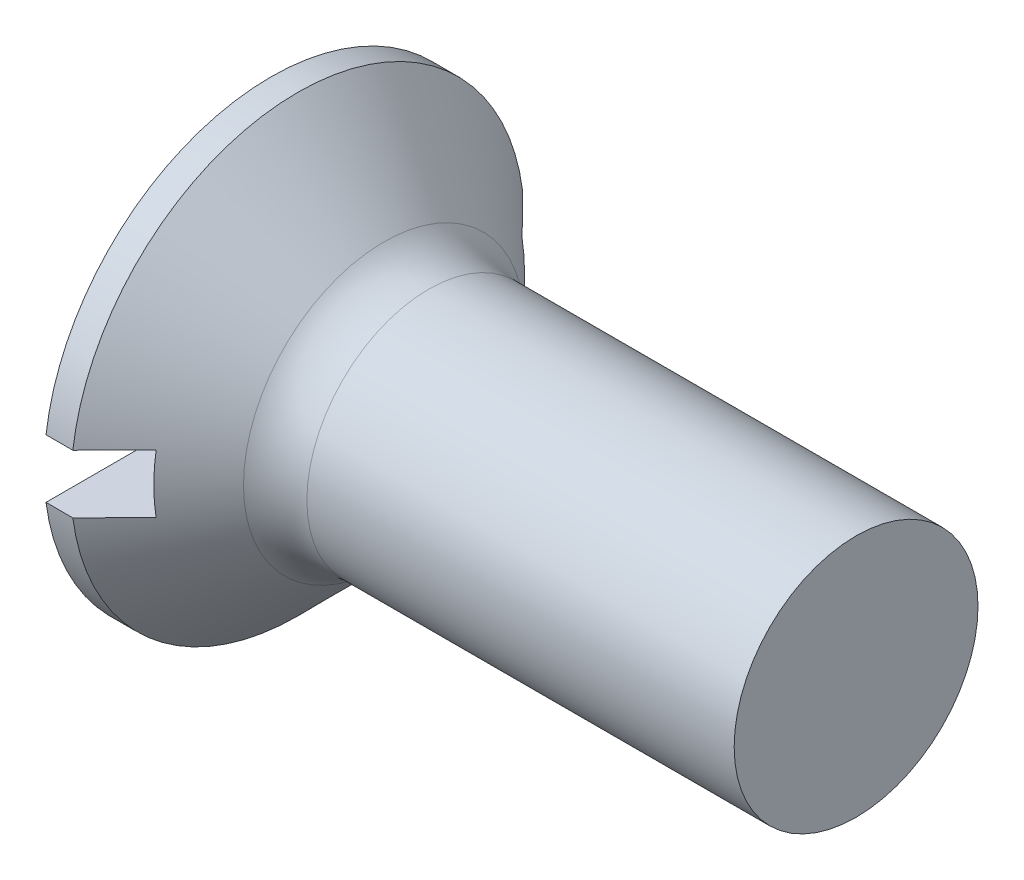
ISO-10303-21;
HEADER;
FILE_DESCRIPTION(('STEP AP214'),'2;1');
FILE_NAME('part.step','',(''),(''),'','','');
FILE_SCHEMA(('AUTOMOTIVE_DESIGN { 1 0 10303 214 1 1 1 1 }'));
ENDSEC;
DATA;
#1=APPLICATION_CONTEXT('core data for automotive mechanical design processes');
#2=APPLICATION_PROTOCOL_DEFINITION('international standard','automotive_design',2000,#1);
#3=PRODUCT_CONTEXT('',#1,'mechanical');
#4=PRODUCT('Part','Part','',(#3));
#5=PRODUCT_RELATED_PRODUCT_CATEGORY('part','',(#4));
#6=PRODUCT_DEFINITION_FORMATION('','',#4);
#7=PRODUCT_DEFINITION_CONTEXT('part definition',#1,'design');
#8=PRODUCT_DEFINITION('design','',#6,#7);
#9=PRODUCT_DEFINITION_SHAPE('','',#8);
#10=(LENGTH_UNIT() NAMED_UNIT(*) SI_UNIT(.MILLI.,.METRE.));
#11=(NAMED_UNIT(*) PLANE_ANGLE_UNIT() SI_UNIT($,.RADIAN.));
#12=(NAMED_UNIT(*) SI_UNIT($,.STERADIAN.) SOLID_ANGLE_UNIT());
#13=UNCERTAINTY_MEASURE_WITH_UNIT(LENGTH_MEASURE(1.E-05),#10,'distance_accuracy_value','');
#14=(GEOMETRIC_REPRESENTATION_CONTEXT(3) GLOBAL_UNCERTAINTY_ASSIGNED_CONTEXT((#13)) GLOBAL_UNIT_ASSIGNED_CONTEXT((#10,
#11,#12)) REPRESENTATION_CONTEXT('',''));
#15=CARTESIAN_POINT('',(0.,0.,0.));
#16=DIRECTION('',(0.,0.,1.));
#17=DIRECTION('',(1.,0.,0.));
#18=AXIS2_PLACEMENT_3D('',#15,#16,#17);
#19=CARTESIAN_POINT('',(0.,0.,0.));
#20=DIRECTION('',(-1.,0.,0.));
#21=DIRECTION('',(0.,0.,1.));
#22=AXIS2_PLACEMENT_3D('',#19,#20,#21);
#23=PLANE('',#22);
#24=DIRECTION('',(0.,0.,-1.));
#25=VECTOR('',#24,1.);
#26=CARTESIAN_POINT('',(0.,0.600000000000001,4.65));
#27=LINE('',#26,#25);
#28=CARTESIAN_POINT('',(0.,0.600000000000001,4.61112784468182));
#29=VERTEX_POINT('',#28);
#30=CARTESIAN_POINT('',(0.,0.599999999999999,-4.61112784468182));
#31=VERTEX_POINT('',#30);
#32=EDGE_CURVE('E169',#29,#31,#27,.T.);
#33=ORIENTED_EDGE('',*,*,#32,.F.);
#34=CARTESIAN_POINT('',(0.,0.,0.));
#35=DIRECTION('',(-1.,0.,0.));
#36=DIRECTION('',(0.,0.,1.));
#37=AXIS2_PLACEMENT_3D('',#34,#35,#36);
#38=CIRCLE('',#37,4.65);
#39=EDGE_CURVE('E113',#29,#31,#38,.T.);
#40=ORIENTED_EDGE('',*,*,#39,.T.);
#41=EDGE_LOOP('',(#33,#40));
#42=FACE_BOUND('',#41,.T.);
#43=ADVANCED_FACE('F32',(#42),#23,.T.);
#44=CARTESIAN_POINT('',(-6.34999999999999,0.,0.));
#45=DIRECTION('',(-1.,0.,0.));
#46=DIRECTION('',(0.,0.,1.));
#47=AXIS2_PLACEMENT_3D('',#44,#45,#46);
#48=CYLINDRICAL_SURFACE('',#47,4.65);
#49=DIRECTION('',(-1.,0.,0.));
#50=VECTOR('',#49,1.);
#51=CARTESIAN_POINT('',(-6.34999999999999,0.599999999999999,-4.61112784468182));
#52=LINE('',#51,#50);
#53=CARTESIAN_POINT('',(0.550000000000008,0.599999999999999,-4.61112784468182));
#54=VERTEX_POINT('',#53);
#55=EDGE_CURVE('E60',#31,#54,#52,.F.);
#56=ORIENTED_EDGE('',*,*,#55,.F.);
#57=ORIENTED_EDGE('',*,*,#39,.F.);
#58=DIRECTION('',(-1.,0.,0.));
#59=VECTOR('',#58,1.);
#60=CARTESIAN_POINT('',(-6.34999999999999,0.600000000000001,4.61112784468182));
#61=LINE('',#60,#59);
#62=CARTESIAN_POINT('',(0.550000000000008,0.600000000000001,4.61112784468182));
#63=VERTEX_POINT('',#62);
#64=EDGE_CURVE('E175',#63,#29,#61,.T.);
#65=ORIENTED_EDGE('',*,*,#64,.F.);
#66=CARTESIAN_POINT('',(0.550000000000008,0.,0.));
#67=DIRECTION('',(-1.,0.,0.));
#68=DIRECTION('',(0.,0.,1.));
#69=AXIS2_PLACEMENT_3D('',#66,#67,#68);
#70=CIRCLE('',#69,4.65);
#71=EDGE_CURVE('E107',#63,#54,#70,.T.);
#72=ORIENTED_EDGE('',*,*,#71,.T.);
#73=EDGE_LOOP('',(#56,#57,#65,#72));
#74=FACE_BOUND('',#73,.T.);
#75=ADVANCED_FACE('F153',(#74),#48,.T.);
#76=DIRECTION('',(0.,0.,1.));
#77=VECTOR('',#76,1.);
#78=CARTESIAN_POINT('',(0.,-0.600000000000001,-4.65));
#79=LINE('',#78,#77);
#80=CARTESIAN_POINT('',(0.,-0.600000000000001,-4.61112784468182));
#81=VERTEX_POINT('',#80);
#82=CARTESIAN_POINT('',(0.,-0.600000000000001,4.61112784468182));
#83=VERTEX_POINT('',#82);
#84=EDGE_CURVE('E101',#81,#83,#79,.T.);
#85=ORIENTED_EDGE('',*,*,#84,.F.);
#86=EDGE_CURVE('E109',#81,#83,#38,.T.);
#87=ORIENTED_EDGE('',*,*,#86,.T.);
#88=EDGE_LOOP('',(#85,#87));
#89=FACE_BOUND('',#88,.T.);
#90=ADVANCED_FACE('F155',(#89),#23,.T.);
#91=DIRECTION('',(-1.,0.,0.));
#92=VECTOR('',#91,1.);
#93=CARTESIAN_POINT('',(-6.34999999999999,-0.600000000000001,4.61112784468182));
#94=LINE('',#93,#92);
#95=CARTESIAN_POINT('',(0.550000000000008,-0.600000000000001,4.61112784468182));
#96=VERTEX_POINT('',#95);
#97=EDGE_CURVE('E174',#83,#96,#94,.F.);
#98=ORIENTED_EDGE('',*,*,#97,.F.);
#99=ORIENTED_EDGE('',*,*,#86,.F.);
#100=DIRECTION('',(-1.,0.,0.));
#101=VECTOR('',#100,1.);
#102=CARTESIAN_POINT('',(-6.34999999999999,-0.600000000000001,-4.61112784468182));
#103=LINE('',#102,#101);
#104=CARTESIAN_POINT('',(0.550000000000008,-0.600000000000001,-4.61112784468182));
#105=VERTEX_POINT('',#104);
#106=EDGE_CURVE('E172',#105,#81,#103,.T.);
#107=ORIENTED_EDGE('',*,*,#106,.F.);
#108=EDGE_CURVE('E110',#105,#96,#70,.T.);
#109=ORIENTED_EDGE('',*,*,#108,.T.);
#110=EDGE_LOOP('',(#98,#99,#107,#109));
#111=FACE_BOUND('',#110,.T.);
#112=ADVANCED_FACE('F150',(#111),#48,.T.);
#113=CARTESIAN_POINT('',(0.550000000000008,0.,0.));
#114=DIRECTION('',(-1.,0.,0.));
#115=DIRECTION('',(0.,0.,1.));
#116=AXIS2_PLACEMENT_3D('',#113,#114,#115);
#117=CONICAL_SURFACE('',#116,4.65,0.78539816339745);
#118=CARTESIAN_POINT('',(-5.05345798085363,0.599999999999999,-10.2358878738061));
#119=CARTESIAN_POINT('',(-4.7063338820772,0.599999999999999,-9.88816346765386));
#120=CARTESIAN_POINT('',(-4.35923588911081,0.599999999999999,-9.54041298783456));
#121=CARTESIAN_POINT('',(-3.66512028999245,0.599999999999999,-8.84482295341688));
#122=CARTESIAN_POINT('',(-3.31810268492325,0.599999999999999,-8.49698339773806));
#123=CARTESIAN_POINT('',(-2.6240861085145,0.599999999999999,-7.80108810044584));
#124=CARTESIAN_POINT('',(-2.27708717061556,0.599999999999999,-7.45303232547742));
#125=CARTESIAN_POINT('',(-1.58327190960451,0.599999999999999,-6.75674744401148));
#126=CARTESIAN_POINT('',(-1.23645558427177,0.599999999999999,-6.40851833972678));
#127=CARTESIAN_POINT('',(-0.530234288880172,0.599999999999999,-5.69884909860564));
#128=CARTESIAN_POINT('',(-0.170839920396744,0.599999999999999,-5.3373984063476));
#129=CARTESIAN_POINT('',(0.367846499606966,0.599999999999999,-4.79480605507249));
#130=CARTESIAN_POINT('',(0.547344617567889,0.599999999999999,-4.61386901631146));
#131=CARTESIAN_POINT('',(0.906142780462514,0.599999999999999,-4.251800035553));
#132=CARTESIAN_POINT('',(1.08544282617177,0.6,-4.07066809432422));
#133=CARTESIAN_POINT('',(1.44372217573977,0.6,-3.70815209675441));
#134=CARTESIAN_POINT('',(1.62270153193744,0.6,-3.52676809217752));
#135=CARTESIAN_POINT('',(1.98021132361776,0.6,-3.16355280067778));
#136=CARTESIAN_POINT('',(2.1587417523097,0.6,-2.98172150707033));
#137=CARTESIAN_POINT('',(2.51504600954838,0.6,-2.61734150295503));
#138=CARTESIAN_POINT('',(2.69281988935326,0.6,-2.43479284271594));
#139=CARTESIAN_POINT('',(2.95840184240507,0.6,-2.15993102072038));
#140=CARTESIAN_POINT('',(3.0467482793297,0.6,-2.06813839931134));
#141=CARTESIAN_POINT('',(3.22290791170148,0.6,-1.8840432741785));
#142=CARTESIAN_POINT('',(3.31072111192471,0.6,-1.79174077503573));
#143=CARTESIAN_POINT('',(3.44507973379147,0.6,-1.64924720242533));
#144=CARTESIAN_POINT('',(3.49191887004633,0.6,-1.59933324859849));
#145=CARTESIAN_POINT('',(3.58528403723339,0.6,-1.49921165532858));
#146=CARTESIAN_POINT('',(3.63181006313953,0.6,-1.44900401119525));
#147=CARTESIAN_POINT('',(3.72427703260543,0.6,-1.348388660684));
#148=CARTESIAN_POINT('',(3.77021949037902,0.6,-1.29798234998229));
#149=CARTESIAN_POINT('',(3.86152904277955,0.6,-1.19665513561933));
#150=CARTESIAN_POINT('',(3.90689615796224,0.6,-1.1457342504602));
#151=CARTESIAN_POINT('',(4.01209252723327,0.6,-1.02578570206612));
#152=CARTESIAN_POINT('',(4.07160553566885,0.6,-0.956477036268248));
#153=CARTESIAN_POINT('',(4.15917887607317,0.6,-0.850702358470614));
#154=CARTESIAN_POINT('',(4.18818199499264,0.6,-0.815019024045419));
#155=CARTESIAN_POINT('',(4.24528795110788,0.6,-0.742941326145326));
#156=CARTESIAN_POINT('',(4.27339088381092,0.6,-0.706547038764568));
#157=CARTESIAN_POINT('',(4.32869682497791,0.6,-0.632291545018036));
#158=CARTESIAN_POINT('',(4.35588213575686,0.6,-0.594417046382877));
#159=CARTESIAN_POINT('',(4.40832254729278,0.6,-0.517260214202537));
#160=CARTESIAN_POINT('',(4.43357498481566,0.6,-0.477976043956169));
#161=CARTESIAN_POINT('',(4.48075024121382,0.6,-0.397940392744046));
#162=CARTESIAN_POINT('',(4.50270366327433,0.6,-0.357207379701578));
#163=CARTESIAN_POINT('',(4.54164745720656,0.6,-0.273493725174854));
#164=CARTESIAN_POINT('',(4.55865364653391,0.6,-0.230520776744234));
#165=CARTESIAN_POINT('',(4.58372379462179,0.6,-0.145820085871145));
#166=CARTESIAN_POINT('',(4.59242377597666,0.6,-0.104295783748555));
#167=CARTESIAN_POINT('',(4.59893532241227,0.6,-0.0414391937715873));
#168=CARTESIAN_POINT('',(4.60002000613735,0.6,-0.0204304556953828));
#169=CARTESIAN_POINT('',(4.59997943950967,0.6,0.0215839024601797));
#170=CARTESIAN_POINT('',(4.59885411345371,0.6,0.0425895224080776));
#171=CARTESIAN_POINT('',(4.59227145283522,0.6,0.10501520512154));
#172=CARTESIAN_POINT('',(4.58363501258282,0.6,0.1461245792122));
#173=CARTESIAN_POINT('',(4.565808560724,0.6,0.206345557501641));
#174=CARTESIAN_POINT('',(4.55901965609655,0.6,0.226250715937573));
#175=CARTESIAN_POINT('',(4.54410905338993,0.6,0.265557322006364));
#176=CARTESIAN_POINT('',(4.53598757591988,0.6,0.284958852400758));
#177=CARTESIAN_POINT('',(4.51162458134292,0.6,0.33886087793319));
#178=CARTESIAN_POINT('',(4.49415337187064,0.6,0.372800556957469));
#179=CARTESIAN_POINT('',(4.45684225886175,0.6,0.439365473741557));
#180=CARTESIAN_POINT('',(4.436999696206,0.6,0.471989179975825));
#181=CARTESIAN_POINT('',(4.39563171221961,0.6,0.53629862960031));
#182=CARTESIAN_POINT('',(4.37410080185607,0.6,0.567980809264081));
#183=CARTESIAN_POINT('',(4.32989042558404,0.6,0.630537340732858));
#184=CARTESIAN_POINT('',(4.30721068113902,0.6,0.661411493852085));
#185=CARTESIAN_POINT('',(4.23751211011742,0.6,0.753681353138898));
#186=CARTESIAN_POINT('',(4.18923822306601,0.6,0.814124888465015));
#187=CARTESIAN_POINT('',(4.0909576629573,0.6,0.933321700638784));
#188=CARTESIAN_POINT('',(4.04095530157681,0.6,0.992078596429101));
#189=CARTESIAN_POINT('',(3.94086297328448,0.6,1.10735067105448));
#190=CARTESIAN_POINT('',(3.89079728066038,0.6,1.16388697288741));
#191=CARTESIAN_POINT('',(3.78992367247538,0.6,1.27629304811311));
#192=CARTESIAN_POINT('',(3.73911573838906,0.6,1.33216280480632));
#193=CARTESIAN_POINT('',(3.58591315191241,0.6,1.49908452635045));
#194=CARTESIAN_POINT('',(3.4827535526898,0.6,1.609433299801));
#195=CARTESIAN_POINT('',(3.27521830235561,0.6,1.82922471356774));
#196=CARTESIAN_POINT('',(3.17084134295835,0.6,1.93866611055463));
#197=CARTESIAN_POINT('',(2.96141984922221,0.6,2.15689179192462));
#198=CARTESIAN_POINT('',(2.85637536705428,0.6,2.26567612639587));
#199=CARTESIAN_POINT('',(2.64692360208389,0.6,2.481710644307));
#200=CARTESIAN_POINT('',(2.5425207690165,0.6,2.58896514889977));
#201=CARTESIAN_POINT('',(2.33341496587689,0.6,2.80318525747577));
#202=CARTESIAN_POINT('',(2.22871198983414,0.6,2.91015085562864));
#203=CARTESIAN_POINT('',(1.91438863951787,0.6,3.23063427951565));
#204=CARTESIAN_POINT('',(1.70445280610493,0.6,3.44384256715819));
#205=CARTESIAN_POINT('',(1.22510768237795,0.6,3.9295930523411));
#206=CARTESIAN_POINT('',(0.955548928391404,0.600000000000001,4.20198758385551));
#207=CARTESIAN_POINT('',(0.416004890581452,0.600000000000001,4.74635530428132));
#208=CARTESIAN_POINT('',(0.146019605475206,0.600000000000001,5.01832849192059));
#209=CARTESIAN_POINT('',(-0.664426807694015,0.600000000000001,5.83398149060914));
#210=CARTESIAN_POINT('',(-1.2052682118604,0.600000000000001,6.37728333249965));
#211=CARTESIAN_POINT('',(-2.297244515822,0.600000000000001,7.47334328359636));
#212=CARTESIAN_POINT('',(-2.84838746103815,0.600000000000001,8.02609337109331));
#213=CARTESIAN_POINT('',(-3.95082527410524,0.600000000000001,9.1312059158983));
#214=CARTESIAN_POINT('',(-4.5021200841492,0.600000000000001,9.683568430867));
#215=CARTESIAN_POINT('',(-5.05345798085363,0.600000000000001,10.2358878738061));
#216=B_SPLINE_CURVE_WITH_KNOTS('',3,(#118,#119,#120,#121,#122,#123,#124,#125,#126,#127,#128,
#129,#130,#131,#132,#133,#134,#135,#136,#137,#138,#139,#140,#141,#142,#143,#144,#145,#146,#147,
#148,#149,#150,#151,#152,#153,#154,#155,#156,#157,#158,#159,#160,#161,#162,#163,#164,#165,#166,
#167,#168,#169,#170,#171,#172,#173,#174,#175,#176,#177,#178,#179,#180,#181,#182,#183,#184,#185,
#186,#187,#188,#189,#190,#191,#192,#193,#194,#195,#196,#197,#198,#199,#200,#201,#202,#203,#204,
#205,#206,#207,#208,#209,#210,#211,#212,#213,#214,#215),.UNSPECIFIED.,.F.,.F.,(4,2,2,2,2,2,2,2,
2,2,2,2,2,2,2,2,2,2,2,2,2,2,2,2,2,2,2,2,2,2,2,2,2,2,2,2,2,2,2,2,2,2,2,2,2,2,2,2,4),(0.,
1.47399683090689,2.94801247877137,4.4224478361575,5.89686482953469,7.42601395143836,
8.19061836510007,8.95521977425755,9.71968231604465,10.4841563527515,11.2485777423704,
11.630779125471,12.0129770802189,12.2183239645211,12.4236741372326,12.6282760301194,
12.8328705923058,13.1068888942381,13.2448295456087,13.3827555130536,13.522578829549,
13.6625914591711,13.8012122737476,13.9393848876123,14.0658401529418,14.1288404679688,
14.1918429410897,14.3170190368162,14.3800826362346,14.4431358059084,14.557498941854,
14.6719915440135,14.7868731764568,14.9017827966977,15.1337679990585,15.365211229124,
15.5917537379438,15.8183019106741,16.2714608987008,16.7251625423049,17.1788291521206,
17.6278622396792,18.076904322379,18.9745538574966,20.1242253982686,21.2739004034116,
23.5737206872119,25.9154338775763,28.2566456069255),.UNSPECIFIED.);
#217=CARTESIAN_POINT('',(1.4,0.6,3.75233260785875));
#218=VERTEX_POINT('',#217);
#219=EDGE_CURVE('E11',#218,#63,#216,.T.);
#220=ORIENTED_EDGE('',*,*,#219,.F.);
#221=CARTESIAN_POINT('',(1.4,0.,0.));
#222=DIRECTION('',(1.,0.,0.));
#223=DIRECTION('',(0.,0.,-1.));
#224=AXIS2_PLACEMENT_3D('',#221,#222,#223);
#225=CIRCLE('',#224,3.80000000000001);
#226=CARTESIAN_POINT('',(1.4,-0.600000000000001,3.75233260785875));
#227=VERTEX_POINT('',#226);
#228=EDGE_CURVE('E89',#227,#218,#225,.F.);
#229=ORIENTED_EDGE('',*,*,#228,.F.);
#230=CARTESIAN_POINT('',(-5.05345798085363,-0.600000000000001,10.2358878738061));
#231=CARTESIAN_POINT('',(-4.7063338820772,-0.600000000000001,9.88816346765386));
#232=CARTESIAN_POINT('',(-4.35923588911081,-0.600000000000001,9.54041298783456));
#233=CARTESIAN_POINT('',(-3.66512028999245,-0.600000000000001,8.84482295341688));
#234=CARTESIAN_POINT('',(-3.31810268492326,-0.600000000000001,8.49698339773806));
#235=CARTESIAN_POINT('',(-2.6240861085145,-0.600000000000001,7.80108810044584));
#236=CARTESIAN_POINT('',(-2.27708717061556,-0.600000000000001,7.45303232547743));
#237=CARTESIAN_POINT('',(-1.58327190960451,-0.600000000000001,6.75674744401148));
#238=CARTESIAN_POINT('',(-1.23645558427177,-0.600000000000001,6.40851833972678));
#239=CARTESIAN_POINT('',(-0.530234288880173,-0.600000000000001,5.69884909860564));
#240=CARTESIAN_POINT('',(-0.170839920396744,-0.600000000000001,5.3373984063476));
#241=CARTESIAN_POINT('',(0.367846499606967,-0.600000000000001,4.79480605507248));
#242=CARTESIAN_POINT('',(0.547344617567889,-0.600000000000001,4.61386901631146));
#243=CARTESIAN_POINT('',(0.906142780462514,-0.600000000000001,4.251800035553));
#244=CARTESIAN_POINT('',(1.08544282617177,-0.600000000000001,4.07066809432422));
#245=CARTESIAN_POINT('',(1.44372217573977,-0.600000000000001,3.70815209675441));
#246=CARTESIAN_POINT('',(1.62270153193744,-0.600000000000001,3.52676809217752));
#247=CARTESIAN_POINT('',(1.98021132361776,-0.600000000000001,3.16355280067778));
#248=CARTESIAN_POINT('',(2.1587417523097,-0.600000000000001,2.98172150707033));
#249=CARTESIAN_POINT('',(2.51504600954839,-0.600000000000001,2.61734150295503));
#250=CARTESIAN_POINT('',(2.69281988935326,-0.600000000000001,2.43479284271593));
#251=CARTESIAN_POINT('',(2.95840184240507,-0.600000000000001,2.15993102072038));
#252=CARTESIAN_POINT('',(3.0467482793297,-0.600000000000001,2.06813839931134));
#253=CARTESIAN_POINT('',(3.22290791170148,-0.600000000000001,1.8840432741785));
#254=CARTESIAN_POINT('',(3.31072111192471,-0.600000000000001,1.79174077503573));
#255=CARTESIAN_POINT('',(3.44507973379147,-0.600000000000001,1.64924720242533));
#256=CARTESIAN_POINT('',(3.49191887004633,-0.600000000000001,1.59933324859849));
#257=CARTESIAN_POINT('',(3.58528403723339,-0.600000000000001,1.49921165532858));
#258=CARTESIAN_POINT('',(3.63181006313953,-0.600000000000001,1.44900401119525));
#259=CARTESIAN_POINT('',(3.72427703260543,-0.600000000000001,1.348388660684));
#260=CARTESIAN_POINT('',(3.77021949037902,-0.600000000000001,1.29798234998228));
#261=CARTESIAN_POINT('',(3.86152904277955,-0.600000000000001,1.19665513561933));
#262=CARTESIAN_POINT('',(3.90689615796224,-0.600000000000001,1.1457342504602));
#263=CARTESIAN_POINT('',(4.01209252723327,-0.600000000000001,1.02578570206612));
#264=CARTESIAN_POINT('',(4.07160553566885,-0.600000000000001,0.956477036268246));
#265=CARTESIAN_POINT('',(4.15917887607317,-0.600000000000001,0.850702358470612));
#266=CARTESIAN_POINT('',(4.18818199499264,-0.600000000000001,0.815019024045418));
#267=CARTESIAN_POINT('',(4.24528795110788,-0.600000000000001,0.742941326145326));
#268=CARTESIAN_POINT('',(4.27339088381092,-0.600000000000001,0.706547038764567));
#269=CARTESIAN_POINT('',(4.32869682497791,-0.600000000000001,0.632291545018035));
#270=CARTESIAN_POINT('',(4.35588213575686,-0.600000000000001,0.594417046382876));
#271=CARTESIAN_POINT('',(4.40832254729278,-0.600000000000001,0.517260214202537));
#272=CARTESIAN_POINT('',(4.43357498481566,-0.600000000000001,0.477976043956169));
#273=CARTESIAN_POINT('',(4.48075024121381,-0.600000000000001,0.397940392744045));
#274=CARTESIAN_POINT('',(4.50270366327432,-0.600000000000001,0.357207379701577));
#275=CARTESIAN_POINT('',(4.54164745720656,-0.600000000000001,0.273493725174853));
#276=CARTESIAN_POINT('',(4.55865364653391,-0.600000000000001,0.230520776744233));
#277=CARTESIAN_POINT('',(4.58372379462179,-0.600000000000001,0.145820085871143));
#278=CARTESIAN_POINT('',(4.59242377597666,-0.600000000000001,0.104295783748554));
#279=CARTESIAN_POINT('',(4.59893532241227,-0.600000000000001,0.0414391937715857));
#280=CARTESIAN_POINT('',(4.60002000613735,-0.600000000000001,0.0204304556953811));
#281=CARTESIAN_POINT('',(4.59997943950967,-0.600000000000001,-0.0215839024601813));
#282=CARTESIAN_POINT('',(4.59885411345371,-0.600000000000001,-0.0425895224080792));
#283=CARTESIAN_POINT('',(4.59227145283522,-0.600000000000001,-0.105015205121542));
#284=CARTESIAN_POINT('',(4.58363501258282,-0.600000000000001,-0.146124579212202));
#285=CARTESIAN_POINT('',(4.565808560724,-0.600000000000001,-0.206345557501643));
#286=CARTESIAN_POINT('',(4.55901965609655,-0.600000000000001,-0.226250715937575));
#287=CARTESIAN_POINT('',(4.54410905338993,-0.600000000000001,-0.265557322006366));
#288=CARTESIAN_POINT('',(4.53598757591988,-0.600000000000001,-0.284958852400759));
#289=CARTESIAN_POINT('',(4.51162458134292,-0.600000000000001,-0.338860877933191));
#290=CARTESIAN_POINT('',(4.49415337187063,-0.600000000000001,-0.37280055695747));
#291=CARTESIAN_POINT('',(4.45684225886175,-0.600000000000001,-0.439365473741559));
#292=CARTESIAN_POINT('',(4.43699969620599,-0.600000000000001,-0.471989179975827));
#293=CARTESIAN_POINT('',(4.3956317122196,-0.600000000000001,-0.536298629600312));
#294=CARTESIAN_POINT('',(4.37410080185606,-0.600000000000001,-0.567980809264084));
#295=CARTESIAN_POINT('',(4.32989042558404,-0.600000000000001,-0.630537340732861));
#296=CARTESIAN_POINT('',(4.30721068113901,-0.600000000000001,-0.661411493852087));
#297=CARTESIAN_POINT('',(4.23751211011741,-0.600000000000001,-0.753681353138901));
#298=CARTESIAN_POINT('',(4.18923822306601,-0.600000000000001,-0.814124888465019));
#299=CARTESIAN_POINT('',(4.09095766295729,-0.600000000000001,-0.933321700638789));
#300=CARTESIAN_POINT('',(4.04095530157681,-0.600000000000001,-0.992078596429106));
#301=CARTESIAN_POINT('',(3.94086297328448,-0.600000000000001,-1.10735067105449));
#302=CARTESIAN_POINT('',(3.89079728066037,-0.600000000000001,-1.16388697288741));
#303=CARTESIAN_POINT('',(3.78992367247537,-0.600000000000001,-1.27629304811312));
#304=CARTESIAN_POINT('',(3.73911573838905,-0.600000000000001,-1.33216280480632));
#305=CARTESIAN_POINT('',(3.5859131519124,-0.600000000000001,-1.49908452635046));
#306=CARTESIAN_POINT('',(3.48275355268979,-0.600000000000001,-1.60943329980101));
#307=CARTESIAN_POINT('',(3.2752183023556,-0.600000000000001,-1.82922471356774));
#308=CARTESIAN_POINT('',(3.17084134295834,-0.600000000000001,-1.93866611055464));
#309=CARTESIAN_POINT('',(2.9614198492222,-0.600000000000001,-2.15689179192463));
#310=CARTESIAN_POINT('',(2.85637536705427,-0.600000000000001,-2.26567612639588));
#311=CARTESIAN_POINT('',(2.64692360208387,-0.600000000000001,-2.48171064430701));
#312=CARTESIAN_POINT('',(2.54252076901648,-0.600000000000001,-2.58896514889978));
#313=CARTESIAN_POINT('',(2.33341496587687,-0.600000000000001,-2.80318525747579));
#314=CARTESIAN_POINT('',(2.22871198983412,-0.600000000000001,-2.91015085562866));
#315=CARTESIAN_POINT('',(1.91438863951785,-0.600000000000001,-3.23063427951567));
#316=CARTESIAN_POINT('',(1.70445280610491,-0.600000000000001,-3.44384256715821));
#317=CARTESIAN_POINT('',(1.22510768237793,-0.600000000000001,-3.92959305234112));
#318=CARTESIAN_POINT('',(0.955548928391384,-0.600000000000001,-4.20198758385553));
#319=CARTESIAN_POINT('',(0.416004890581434,-0.600000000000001,-4.74635530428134));
#320=CARTESIAN_POINT('',(0.146019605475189,-0.600000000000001,-5.01832849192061));
#321=CARTESIAN_POINT('',(-0.66442680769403,-0.600000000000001,-5.83398149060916));
#322=CARTESIAN_POINT('',(-1.20526821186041,-0.600000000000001,-6.37728333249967));
#323=CARTESIAN_POINT('',(-2.29724451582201,-0.600000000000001,-7.47334328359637));
#324=CARTESIAN_POINT('',(-2.84838746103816,-0.600000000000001,-8.02609337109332));
#325=CARTESIAN_POINT('',(-3.95082527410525,-0.600000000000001,-9.13120591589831));
#326=CARTESIAN_POINT('',(-4.5021200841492,-0.600000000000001,-9.68356843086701));
#327=CARTESIAN_POINT('',(-5.05345798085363,-0.600000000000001,-10.2358878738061));
#328=B_SPLINE_CURVE_WITH_KNOTS('',3,(#230,#231,#232,#233,#234,#235,#236,#237,#238,#239,#240,
#241,#242,#243,#244,#245,#246,#247,#248,#249,#250,#251,#252,#253,#254,#255,#256,#257,#258,#259,
#260,#261,#262,#263,#264,#265,#266,#267,#268,#269,#270,#271,#272,#273,#274,#275,#276,#277,#278,
#279,#280,#281,#282,#283,#284,#285,#286,#287,#288,#289,#290,#291,#292,#293,#294,#295,#296,#297,
#298,#299,#300,#301,#302,#303,#304,#305,#306,#307,#308,#309,#310,#311,#312,#313,#314,#315,#316,
#317,#318,#319,#320,#321,#322,#323,#324,#325,#326,#327),.UNSPECIFIED.,.F.,.F.,(4,2,2,2,2,2,2,2,
2,2,2,2,2,2,2,2,2,2,2,2,2,2,2,2,2,2,2,2,2,2,2,2,2,2,2,2,2,2,2,2,2,2,2,2,2,2,2,2,4),(0.,
1.47399683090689,2.94801247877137,4.4224478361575,5.89686482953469,7.42601395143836,
8.19061836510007,8.95521977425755,9.71968231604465,10.4841563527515,11.2485777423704,
11.630779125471,12.0129770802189,12.2183239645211,12.4236741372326,12.6282760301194,
12.8328705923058,13.1068888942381,13.2448295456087,13.3827555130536,13.522578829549,
13.6625914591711,13.8012122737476,13.9393848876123,14.0658401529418,14.1288404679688,
14.1918429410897,14.3170190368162,14.3800826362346,14.4431358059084,14.557498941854,
14.6719915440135,14.7868731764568,14.9017827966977,15.1337679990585,15.365211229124,
15.5917537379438,15.8183019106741,16.2714608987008,16.7251625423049,17.1788291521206,
17.6278622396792,18.076904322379,18.9745538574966,20.1242253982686,21.2739004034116,
23.5737206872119,25.9154338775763,28.2566456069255),.UNSPECIFIED.);
#329=EDGE_CURVE('E46',#96,#227,#328,.T.);
#330=ORIENTED_EDGE('',*,*,#329,.F.);
#331=ORIENTED_EDGE('',*,*,#108,.F.);
#332=CARTESIAN_POINT('',(1.4,-0.600000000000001,-3.75233260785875));
#333=VERTEX_POINT('',#332);
#334=EDGE_CURVE('E125',#333,#105,#328,.T.);
#335=ORIENTED_EDGE('',*,*,#334,.F.);
#336=CARTESIAN_POINT('',(1.4,0.6,-3.75233260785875));
#337=VERTEX_POINT('',#336);
#338=EDGE_CURVE('E97',#337,#333,#225,.F.);
#339=ORIENTED_EDGE('',*,*,#338,.F.);
#340=EDGE_CURVE('E36',#54,#337,#216,.T.);
#341=ORIENTED_EDGE('',*,*,#340,.F.);
#342=ORIENTED_EDGE('',*,*,#71,.F.);
#343=EDGE_LOOP('',(#220,#229,#330,#331,#335,#339,#341,#342));
#344=FACE_BOUND('',#343,.T.);
#345=CARTESIAN_POINT('',(2.31923881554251,0.,0.));
#346=DIRECTION('',(-1.,0.,0.));
#347=DIRECTION('',(0.,0.,1.));
#348=AXIS2_PLACEMENT_3D('',#345,#346,#347);
#349=CIRCLE('',#348,2.88076118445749);
#350=CARTESIAN_POINT('',(2.31923881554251,0.,2.88076118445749));
#351=VERTEX_POINT('',#350);
#352=EDGE_CURVE('E120',#351,#351,#349,.T.);
#353=ORIENTED_EDGE('',*,*,#352,.T.);
#354=EDGE_LOOP('',(#353));
#355=FACE_BOUND('',#354,.T.);
#356=ADVANCED_FACE('F104',(#344,#355),#117,.T.);
#357=CARTESIAN_POINT('',(-6.34999999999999,0.,0.));
#358=DIRECTION('',(-1.,0.,0.));
#359=DIRECTION('',(0.,0.,1.));
#360=AXIS2_PLACEMENT_3D('',#357,#358,#359);
#361=CYLINDRICAL_SURFACE('',#360,2.5);
#362=CARTESIAN_POINT('',(3.23847763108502,0.,0.));
#363=DIRECTION('',(-1.,0.,0.));
#364=DIRECTION('',(0.,0.,1.));
#365=AXIS2_PLACEMENT_3D('',#362,#363,#364);
#366=CIRCLE('',#365,2.5);
#367=CARTESIAN_POINT('',(3.23847763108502,0.,2.5));
#368=VERTEX_POINT('',#367);
#369=EDGE_CURVE('E123',#368,#368,#366,.F.);
#370=ORIENTED_EDGE('',*,*,#369,.T.);
#371=EDGE_LOOP('',(#370));
#372=FACE_BOUND('',#371,.T.);
#373=CARTESIAN_POINT('',(12.,0.,0.));
#374=DIRECTION('',(-1.,0.,0.));
#375=DIRECTION('',(0.,0.,1.));
#376=AXIS2_PLACEMENT_3D('',#373,#374,#375);
#377=CIRCLE('',#376,2.5);
#378=CARTESIAN_POINT('',(12.,0.,2.5));
#379=VERTEX_POINT('',#378);
#380=EDGE_CURVE('E116',#379,#379,#377,.T.);
#381=ORIENTED_EDGE('',*,*,#380,.T.);
#382=EDGE_LOOP('',(#381));
#383=FACE_BOUND('',#382,.T.);
#384=ADVANCED_FACE('F143',(#372,#383),#361,.T.);
#385=CARTESIAN_POINT('',(12.,2.5,0.));
#386=DIRECTION('',(1.,0.,0.));
#387=DIRECTION('',(0.,0.,-1.));
#388=AXIS2_PLACEMENT_3D('',#385,#386,#387);
#389=PLANE('',#388);
#390=ORIENTED_EDGE('',*,*,#380,.F.);
#391=EDGE_LOOP('',(#390));
#392=FACE_BOUND('',#391,.T.);
#393=ADVANCED_FACE('F141',(#392),#389,.T.);
#394=CARTESIAN_POINT('',(3.23847763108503,0.,0.));
#395=DIRECTION('',(-1.,0.,0.));
#396=DIRECTION('',(0.,0.,1.));
#397=AXIS2_PLACEMENT_3D('',#394,#395,#396);
#398=TOROIDAL_SURFACE('',#397,3.8,1.3);
#399=ORIENTED_EDGE('',*,*,#369,.F.);
#400=EDGE_LOOP('',(#399));
#401=FACE_BOUND('',#400,.T.);
#402=ORIENTED_EDGE('',*,*,#352,.F.);
#403=EDGE_LOOP('',(#402));
#404=FACE_BOUND('',#403,.T.);
#405=ADVANCED_FACE('F34',(#401,#404),#398,.F.);
#406=CARTESIAN_POINT('',(1.4,0.600000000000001,4.65));
#407=DIRECTION('',(0.,1.,0.));
#408=DIRECTION('',(0.,0.,1.));
#409=AXIS2_PLACEMENT_3D('',#406,#407,#408);
#410=PLANE('',#409);
#411=ORIENTED_EDGE('',*,*,#55,.T.);
#412=ORIENTED_EDGE('',*,*,#340,.T.);
#413=DIRECTION('',(0.,0.,-1.));
#414=VECTOR('',#413,1.);
#415=CARTESIAN_POINT('',(1.4,0.600000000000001,4.65));
#416=LINE('',#415,#414);
#417=EDGE_CURVE('E53',#218,#337,#416,.T.);
#418=ORIENTED_EDGE('',*,*,#417,.F.);
#419=ORIENTED_EDGE('',*,*,#219,.T.);
#420=ORIENTED_EDGE('',*,*,#64,.T.);
#421=ORIENTED_EDGE('',*,*,#32,.T.);
#422=EDGE_LOOP('',(#411,#412,#418,#419,#420,#421));
#423=FACE_BOUND('',#422,.T.);
#424=ADVANCED_FACE('F98',(#423),#410,.F.);
#425=CARTESIAN_POINT('',(1.4,-0.600000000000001,-4.65));
#426=DIRECTION('',(0.,-1.,0.));
#427=DIRECTION('',(0.,0.,-1.));
#428=AXIS2_PLACEMENT_3D('',#425,#426,#427);
#429=PLANE('',#428);
#430=ORIENTED_EDGE('',*,*,#97,.T.);
#431=ORIENTED_EDGE('',*,*,#329,.T.);
#432=DIRECTION('',(0.,0.,1.));
#433=VECTOR('',#432,1.);
#434=CARTESIAN_POINT('',(1.4,-0.600000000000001,-4.65));
#435=LINE('',#434,#433);
#436=EDGE_CURVE('E92',#333,#227,#435,.T.);
#437=ORIENTED_EDGE('',*,*,#436,.F.);
#438=ORIENTED_EDGE('',*,*,#334,.T.);
#439=ORIENTED_EDGE('',*,*,#106,.T.);
#440=ORIENTED_EDGE('',*,*,#84,.T.);
#441=EDGE_LOOP('',(#430,#431,#437,#438,#439,#440));
#442=FACE_BOUND('',#441,.T.);
#443=ADVANCED_FACE('F133',(#442),#429,.F.);
#444=CARTESIAN_POINT('',(1.4,-0.600000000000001,-4.65));
#445=DIRECTION('',(1.,0.,0.));
#446=DIRECTION('',(0.,0.,-1.));
#447=AXIS2_PLACEMENT_3D('',#444,#445,#446);
#448=PLANE('',#447);
#449=ORIENTED_EDGE('',*,*,#228,.T.);
#450=ORIENTED_EDGE('',*,*,#417,.T.);
#451=ORIENTED_EDGE('',*,*,#338,.T.);
#452=ORIENTED_EDGE('',*,*,#436,.T.);
#453=EDGE_LOOP('',(#449,#450,#451,#452));
#454=FACE_BOUND('',#453,.T.);
#455=ADVANCED_FACE('F90',(#454),#448,.F.);
#456=CLOSED_SHELL('',(#43,#75,#90,#112,#356,#384,#393,#405,#424,#443,#455));
#457=MANIFOLD_SOLID_BREP('B2',#456);
#458=ADVANCED_BREP_SHAPE_REPRESENTATION('',(#18,#457),#14);
#459=SHAPE_DEFINITION_REPRESENTATION(#9,#458);
ENDSEC;
END-ISO-10303-21;
